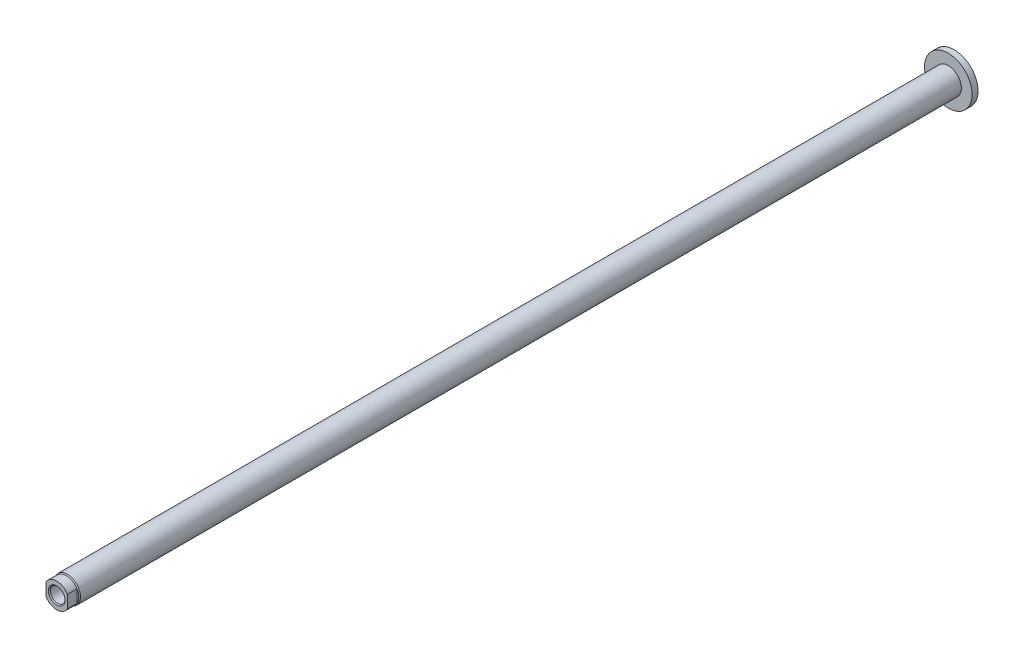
ISO-10303-21;
HEADER;
FILE_DESCRIPTION(('STEP AP214'),'2;1');
FILE_NAME('part.step','',(''),(''),'','','');
FILE_SCHEMA(('AUTOMOTIVE_DESIGN { 1 0 10303 214 1 1 1 1 }'));
ENDSEC;
DATA;
#1=APPLICATION_CONTEXT('core data for automotive mechanical design processes');
#2=APPLICATION_PROTOCOL_DEFINITION('international standard','automotive_design',2000,#1);
#3=PRODUCT_CONTEXT('',#1,'mechanical');
#4=PRODUCT('Part','Part','',(#3));
#5=PRODUCT_RELATED_PRODUCT_CATEGORY('part','',(#4));
#6=PRODUCT_DEFINITION_FORMATION('','',#4);
#7=PRODUCT_DEFINITION_CONTEXT('part definition',#1,'design');
#8=PRODUCT_DEFINITION('design','',#6,#7);
#9=PRODUCT_DEFINITION_SHAPE('','',#8);
#10=(LENGTH_UNIT() NAMED_UNIT(*) SI_UNIT(.MILLI.,.METRE.));
#11=(NAMED_UNIT(*) PLANE_ANGLE_UNIT() SI_UNIT($,.RADIAN.));
#12=(NAMED_UNIT(*) SI_UNIT($,.STERADIAN.) SOLID_ANGLE_UNIT());
#13=UNCERTAINTY_MEASURE_WITH_UNIT(LENGTH_MEASURE(1.E-05),#10,'distance_accuracy_value','');
#14=(GEOMETRIC_REPRESENTATION_CONTEXT(3) GLOBAL_UNCERTAINTY_ASSIGNED_CONTEXT((#13)) GLOBAL_UNIT_ASSIGNED_CONTEXT((#10,
#11,#12)) REPRESENTATION_CONTEXT('',''));
#15=CARTESIAN_POINT('',(0.,0.,0.));
#16=DIRECTION('',(0.,0.,1.));
#17=DIRECTION('',(1.,0.,0.));
#18=AXIS2_PLACEMENT_3D('',#15,#16,#17);
#19=CARTESIAN_POINT('',(0.,5.5,-735.));
#20=DIRECTION('',(0.,0.,-1.));
#21=DIRECTION('',(0.,1.,0.));
#22=AXIS2_PLACEMENT_3D('',#19,#20,#21);
#23=PLANE('',#22);
#24=CARTESIAN_POINT('',(0.,0.,-735.));
#25=DIRECTION('',(0.,0.,-1.));
#26=DIRECTION('',(-1.,0.,0.));
#27=AXIS2_PLACEMENT_3D('',#24,#25,#26);
#28=CIRCLE('',#27,20.);
#29=CARTESIAN_POINT('',(-20.,0.,-735.));
#30=VERTEX_POINT('',#29);
#31=EDGE_CURVE('E118',#30,#30,#28,.T.);
#32=ORIENTED_EDGE('',*,*,#31,.T.);
#33=EDGE_LOOP('',(#32));
#34=FACE_BOUND('',#33,.T.);
#35=ADVANCED_FACE('F16',(#34),#23,.T.);
#36=CARTESIAN_POINT('',(0.,0.,-362.476313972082));
#37=DIRECTION('',(0.,0.,1.));
#38=DIRECTION('',(0.,1.,0.));
#39=AXIS2_PLACEMENT_3D('',#36,#37,#38);
#40=CYLINDRICAL_SURFACE('',#39,11.);
#41=CARTESIAN_POINT('',(0.,0.,10.0473720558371));
#42=DIRECTION('',(0.,0.,-1.));
#43=DIRECTION('',(0.,1.,0.));
#44=AXIS2_PLACEMENT_3D('',#41,#42,#43);
#45=CIRCLE('',#44,11.);
#46=CARTESIAN_POINT('',(0.,11.,10.0473720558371));
#47=VERTEX_POINT('',#46);
#48=EDGE_CURVE('E11',#47,#47,#45,.T.);
#49=ORIENTED_EDGE('',*,*,#48,.T.);
#50=EDGE_LOOP('',(#49));
#51=FACE_BOUND('',#50,.T.);
#52=CARTESIAN_POINT('',(0.,0.,-730.));
#53=DIRECTION('',(0.,0.,1.));
#54=DIRECTION('',(0.,1.,0.));
#55=AXIS2_PLACEMENT_3D('',#52,#53,#54);
#56=CIRCLE('',#55,11.);
#57=CARTESIAN_POINT('',(0.,-11.,-730.));
#58=VERTEX_POINT('',#57);
#59=EDGE_CURVE('E121',#58,#58,#56,.T.);
#60=ORIENTED_EDGE('',*,*,#59,.T.);
#61=EDGE_LOOP('',(#60));
#62=FACE_BOUND('',#61,.T.);
#63=ADVANCED_FACE('F109',(#51,#62),#40,.T.);
#64=CARTESIAN_POINT('',(0.,0.,10.5236860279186));
#65=DIRECTION('',(0.,0.,-1.));
#66=DIRECTION('',(0.,1.,0.));
#67=AXIS2_PLACEMENT_3D('',#64,#65,#66);
#68=CONICAL_SURFACE('',#67,10.725,0.523598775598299);
#69=CARTESIAN_POINT('',(0.,0.,11.));
#70=DIRECTION('',(0.,0.,-1.));
#71=DIRECTION('',(0.,1.,0.));
#72=AXIS2_PLACEMENT_3D('',#69,#70,#71);
#73=CIRCLE('',#72,10.45);
#74=CARTESIAN_POINT('',(9.,-5.31060260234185,11.));
#75=VERTEX_POINT('',#74);
#76=CARTESIAN_POINT('',(-9.,-5.31060260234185,11.));
#77=VERTEX_POINT('',#76);
#78=EDGE_CURVE('E25',#75,#77,#73,.T.);
#79=ORIENTED_EDGE('',*,*,#78,.T.);
#80=CARTESIAN_POINT('',(0.,0.,11.));
#81=DIRECTION('',(0.,0.,-1.));
#82=DIRECTION('',(0.,1.,0.));
#83=AXIS2_PLACEMENT_3D('',#80,#81,#82);
#84=CIRCLE('',#83,10.45);
#85=CARTESIAN_POINT('',(-9.,5.31060260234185,11.));
#86=VERTEX_POINT('',#85);
#87=EDGE_CURVE('E153',#77,#86,#84,.T.);
#88=ORIENTED_EDGE('',*,*,#87,.T.);
#89=CARTESIAN_POINT('',(0.,0.,11.));
#90=DIRECTION('',(0.,0.,-1.));
#91=DIRECTION('',(0.,1.,0.));
#92=AXIS2_PLACEMENT_3D('',#89,#90,#91);
#93=CIRCLE('',#92,10.45);
#94=CARTESIAN_POINT('',(9.,5.31060260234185,11.));
#95=VERTEX_POINT('',#94);
#96=EDGE_CURVE('E128',#86,#95,#93,.T.);
#97=ORIENTED_EDGE('',*,*,#96,.T.);
#98=CARTESIAN_POINT('',(0.,0.,11.));
#99=DIRECTION('',(0.,0.,-1.));
#100=DIRECTION('',(0.,1.,0.));
#101=AXIS2_PLACEMENT_3D('',#98,#99,#100);
#102=CIRCLE('',#101,10.45);
#103=EDGE_CURVE('E129',#95,#75,#102,.T.);
#104=ORIENTED_EDGE('',*,*,#103,.T.);
#105=EDGE_LOOP('',(#79,#88,#97,#104));
#106=FACE_BOUND('',#105,.T.);
#107=ORIENTED_EDGE('',*,*,#48,.F.);
#108=EDGE_LOOP('',(#107));
#109=FACE_BOUND('',#108,.T.);
#110=ADVANCED_FACE('F114',(#106,#109),#68,.T.);
#111=CARTESIAN_POINT('',(0.,0.,15.));
#112=DIRECTION('',(0.,0.,1.));
#113=DIRECTION('',(0.,1.,0.));
#114=AXIS2_PLACEMENT_3D('',#111,#112,#113);
#115=CYLINDRICAL_SURFACE('',#114,10.45);
#116=DIRECTION('',(0.,0.,-1.));
#117=VECTOR('',#116,1.);
#118=CARTESIAN_POINT('',(-9.,-5.31060260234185,15.));
#119=LINE('',#118,#117);
#120=CARTESIAN_POINT('',(-9.,-5.31060260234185,19.));
#121=VERTEX_POINT('',#120);
#122=EDGE_CURVE('E159',#121,#77,#119,.T.);
#123=ORIENTED_EDGE('',*,*,#122,.T.);
#124=ORIENTED_EDGE('',*,*,#78,.F.);
#125=DIRECTION('',(0.,0.,1.));
#126=VECTOR('',#125,1.);
#127=CARTESIAN_POINT('',(9.,-5.31060260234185,15.));
#128=LINE('',#127,#126);
#129=CARTESIAN_POINT('',(9.,-5.31060260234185,19.));
#130=VERTEX_POINT('',#129);
#131=EDGE_CURVE('E145',#75,#130,#128,.T.);
#132=ORIENTED_EDGE('',*,*,#131,.T.);
#133=CARTESIAN_POINT('',(0.,0.,19.));
#134=DIRECTION('',(0.,0.,-1.));
#135=DIRECTION('',(0.,1.,0.));
#136=AXIS2_PLACEMENT_3D('',#133,#134,#135);
#137=CIRCLE('',#136,10.45);
#138=EDGE_CURVE('E138',#130,#121,#137,.T.);
#139=ORIENTED_EDGE('',*,*,#138,.T.);
#140=EDGE_LOOP('',(#123,#124,#132,#139));
#141=FACE_BOUND('',#140,.T.);
#142=ADVANCED_FACE('F102',(#141),#115,.T.);
#143=CARTESIAN_POINT('',(0.,5.225,19.));
#144=DIRECTION('',(0.,0.,1.));
#145=DIRECTION('',(0.,-1.,0.));
#146=AXIS2_PLACEMENT_3D('',#143,#144,#145);
#147=PLANE('',#146);
#148=CARTESIAN_POINT('',(0.,0.,19.));
#149=DIRECTION('',(0.,0.,-1.));
#150=DIRECTION('',(0.,1.,0.));
#151=AXIS2_PLACEMENT_3D('',#148,#149,#150);
#152=CIRCLE('',#151,7.);
#153=CARTESIAN_POINT('',(0.,7.,19.));
#154=VERTEX_POINT('',#153);
#155=EDGE_CURVE('E19',#154,#154,#152,.T.);
#156=ORIENTED_EDGE('',*,*,#155,.T.);
#157=EDGE_LOOP('',(#156));
#158=FACE_BOUND('',#157,.T.);
#159=DIRECTION('',(0.,-1.,0.));
#160=VECTOR('',#159,1.);
#161=CARTESIAN_POINT('',(-9.,2.6125,19.));
#162=LINE('',#161,#160);
#163=CARTESIAN_POINT('',(-9.,5.31060260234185,19.));
#164=VERTEX_POINT('',#163);
#165=EDGE_CURVE('E135',#164,#121,#162,.T.);
#166=ORIENTED_EDGE('',*,*,#165,.T.);
#167=ORIENTED_EDGE('',*,*,#138,.F.);
#168=DIRECTION('',(0.,1.,0.));
#169=VECTOR('',#168,1.);
#170=CARTESIAN_POINT('',(9.,2.6125,19.));
#171=LINE('',#170,#169);
#172=CARTESIAN_POINT('',(9.,5.31060260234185,19.));
#173=VERTEX_POINT('',#172);
#174=EDGE_CURVE('E74',#130,#173,#171,.T.);
#175=ORIENTED_EDGE('',*,*,#174,.T.);
#176=CARTESIAN_POINT('',(0.,0.,19.));
#177=DIRECTION('',(0.,0.,-1.));
#178=DIRECTION('',(0.,1.,0.));
#179=AXIS2_PLACEMENT_3D('',#176,#177,#178);
#180=CIRCLE('',#179,10.45);
#181=EDGE_CURVE('E134',#164,#173,#180,.T.);
#182=ORIENTED_EDGE('',*,*,#181,.F.);
#183=EDGE_LOOP('',(#166,#167,#175,#182));
#184=FACE_BOUND('',#183,.T.);
#185=ADVANCED_FACE('F91',(#158,#184),#147,.T.);
#186=CARTESIAN_POINT('',(0.,0.,-10.2863578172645));
#187=DIRECTION('',(0.,0.,1.));
#188=DIRECTION('',(0.,1.,0.));
#189=AXIS2_PLACEMENT_3D('',#186,#187,#188);
#190=CONICAL_SURFACE('',#189,3.0940625,1.0471975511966);
#191=CARTESIAN_POINT('',(0.,0.,-8.5));
#192=DIRECTION('',(0.,0.,-1.));
#193=DIRECTION('',(0.,1.,0.));
#194=AXIS2_PLACEMENT_3D('',#191,#192,#193);
#195=CIRCLE('',#194,6.188125);
#196=CARTESIAN_POINT('',(0.,6.188125,-8.5));
#197=VERTEX_POINT('',#196);
#198=EDGE_CURVE('E136',#197,#197,#195,.T.);
#199=ORIENTED_EDGE('',*,*,#198,.F.);
#200=EDGE_LOOP('',(#199));
#201=FACE_BOUND('',#200,.T.);
#202=CARTESIAN_POINT('',(0.,0.,-12.0727156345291));
#203=VERTEX_POINT('',#202);
#204=VERTEX_LOOP('',#203);
#205=FACE_BOUND('',#204,.T.);
#206=ADVANCED_FACE('F88',(#201,#205),#190,.F.);
#207=CARTESIAN_POINT('',(0.,0.,-7.6559375));
#208=DIRECTION('',(0.,0.,1.));
#209=DIRECTION('',(0.,1.,0.));
#210=AXIS2_PLACEMENT_3D('',#207,#208,#209);
#211=CYLINDRICAL_SURFACE('',#210,6.188125);
#212=CARTESIAN_POINT('',(0.,0.,-6.811875));
#213=DIRECTION('',(0.,0.,-1.));
#214=DIRECTION('',(0.,1.,0.));
#215=AXIS2_PLACEMENT_3D('',#212,#213,#214);
#216=CIRCLE('',#215,6.188125);
#217=CARTESIAN_POINT('',(0.,6.188125,-6.811875));
#218=VERTEX_POINT('',#217);
#219=EDGE_CURVE('E139',#218,#218,#216,.T.);
#220=ORIENTED_EDGE('',*,*,#219,.F.);
#221=EDGE_LOOP('',(#220));
#222=FACE_BOUND('',#221,.T.);
#223=ORIENTED_EDGE('',*,*,#198,.T.);
#224=EDGE_LOOP('',(#223));
#225=FACE_BOUND('',#224,.T.);
#226=ADVANCED_FACE('F90',(#222,#225),#211,.F.);
#227=CARTESIAN_POINT('',(0.,0.,-6.4059375));
#228=DIRECTION('',(0.,0.,1.));
#229=DIRECTION('',(0.,1.,0.));
#230=AXIS2_PLACEMENT_3D('',#227,#228,#229);
#231=CONICAL_SURFACE('',#230,6.5940625,0.785398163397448);
#232=CARTESIAN_POINT('',(0.,0.,-6.));
#233=DIRECTION('',(0.,0.,-1.));
#234=DIRECTION('',(0.,1.,0.));
#235=AXIS2_PLACEMENT_3D('',#232,#233,#234);
#236=CIRCLE('',#235,7.);
#237=CARTESIAN_POINT('',(0.,7.,-6.));
#238=VERTEX_POINT('',#237);
#239=EDGE_CURVE('E141',#238,#238,#236,.T.);
#240=ORIENTED_EDGE('',*,*,#239,.F.);
#241=EDGE_LOOP('',(#240));
#242=FACE_BOUND('',#241,.T.);
#243=ORIENTED_EDGE('',*,*,#219,.T.);
#244=EDGE_LOOP('',(#243));
#245=FACE_BOUND('',#244,.T.);
#246=ADVANCED_FACE('F99',(#242,#245),#231,.F.);
#247=CARTESIAN_POINT('',(0.,6.5940625,-6.));
#248=DIRECTION('',(0.,0.,1.));
#249=DIRECTION('',(0.,-1.,0.));
#250=AXIS2_PLACEMENT_3D('',#247,#248,#249);
#251=PLANE('',#250);
#252=CARTESIAN_POINT('',(0.,0.,-6.));
#253=DIRECTION('',(0.,0.,-1.));
#254=DIRECTION('',(0.,1.,0.));
#255=AXIS2_PLACEMENT_3D('',#252,#253,#254);
#256=CIRCLE('',#255,6.188125);
#257=CARTESIAN_POINT('',(0.,6.188125,-6.));
#258=VERTEX_POINT('',#257);
#259=EDGE_CURVE('E148',#258,#258,#256,.T.);
#260=ORIENTED_EDGE('',*,*,#259,.F.);
#261=EDGE_LOOP('',(#260));
#262=FACE_BOUND('',#261,.T.);
#263=ORIENTED_EDGE('',*,*,#239,.T.);
#264=EDGE_LOOP('',(#263));
#265=FACE_BOUND('',#264,.T.);
#266=ADVANCED_FACE('F227',(#262,#265),#251,.F.);
#267=CARTESIAN_POINT('',(0.,0.,6.0940625));
#268=DIRECTION('',(0.,0.,1.));
#269=DIRECTION('',(0.,1.,0.));
#270=AXIS2_PLACEMENT_3D('',#267,#268,#269);
#271=CYLINDRICAL_SURFACE('',#270,6.188125);
#272=CARTESIAN_POINT('',(0.,0.,18.188125));
#273=DIRECTION('',(0.,0.,-1.));
#274=DIRECTION('',(0.,1.,0.));
#275=AXIS2_PLACEMENT_3D('',#272,#273,#274);
#276=CIRCLE('',#275,6.188125);
#277=CARTESIAN_POINT('',(0.,6.188125,18.188125));
#278=VERTEX_POINT('',#277);
#279=EDGE_CURVE('E120',#278,#278,#276,.T.);
#280=ORIENTED_EDGE('',*,*,#279,.F.);
#281=EDGE_LOOP('',(#280));
#282=FACE_BOUND('',#281,.T.);
#283=ORIENTED_EDGE('',*,*,#259,.T.);
#284=EDGE_LOOP('',(#283));
#285=FACE_BOUND('',#284,.T.);
#286=ADVANCED_FACE('F223',(#282,#285),#271,.F.);
#287=CARTESIAN_POINT('',(0.,0.,18.5940625));
#288=DIRECTION('',(0.,0.,1.));
#289=DIRECTION('',(0.,1.,0.));
#290=AXIS2_PLACEMENT_3D('',#287,#288,#289);
#291=CONICAL_SURFACE('',#290,6.5940625,0.785398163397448);
#292=ORIENTED_EDGE('',*,*,#155,.F.);
#293=EDGE_LOOP('',(#292));
#294=FACE_BOUND('',#293,.T.);
#295=ORIENTED_EDGE('',*,*,#279,.T.);
#296=EDGE_LOOP('',(#295));
#297=FACE_BOUND('',#296,.T.);
#298=ADVANCED_FACE('F213',(#294,#297),#291,.F.);
#299=CARTESIAN_POINT('',(0.,0.,-732.5));
#300=DIRECTION('',(0.,0.,1.));
#301=DIRECTION('',(-1.,0.,0.));
#302=AXIS2_PLACEMENT_3D('',#299,#300,#301);
#303=CYLINDRICAL_SURFACE('',#302,20.);
#304=ORIENTED_EDGE('',*,*,#31,.F.);
#305=EDGE_LOOP('',(#304));
#306=FACE_BOUND('',#305,.T.);
#307=CARTESIAN_POINT('',(0.,0.,-730.));
#308=DIRECTION('',(0.,0.,1.));
#309=DIRECTION('',(-1.,0.,0.));
#310=AXIS2_PLACEMENT_3D('',#307,#308,#309);
#311=CIRCLE('',#310,20.);
#312=CARTESIAN_POINT('',(-20.,0.,-730.));
#313=VERTEX_POINT('',#312);
#314=EDGE_CURVE('E124',#313,#313,#311,.T.);
#315=ORIENTED_EDGE('',*,*,#314,.F.);
#316=EDGE_LOOP('',(#315));
#317=FACE_BOUND('',#316,.T.);
#318=ADVANCED_FACE('F208',(#306,#317),#303,.T.);
#319=CARTESIAN_POINT('',(0.,0.,-730.));
#320=DIRECTION('',(0.,0.,1.));
#321=DIRECTION('',(1.,0.,0.));
#322=AXIS2_PLACEMENT_3D('',#319,#320,#321);
#323=PLANE('',#322);
#324=ORIENTED_EDGE('',*,*,#59,.F.);
#325=EDGE_LOOP('',(#324));
#326=FACE_BOUND('',#325,.T.);
#327=ORIENTED_EDGE('',*,*,#314,.T.);
#328=EDGE_LOOP('',(#327));
#329=FACE_BOUND('',#328,.T.);
#330=ADVANCED_FACE('F204',(#326,#329),#323,.T.);
#331=CARTESIAN_POINT('',(9.,0.,15.5));
#332=DIRECTION('',(1.,0.,0.));
#333=DIRECTION('',(0.,0.,-1.));
#334=AXIS2_PLACEMENT_3D('',#331,#332,#333);
#335=PLANE('',#334);
#336=DIRECTION('',(0.,0.,-1.));
#337=VECTOR('',#336,1.);
#338=CARTESIAN_POINT('',(9.,5.31060260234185,15.));
#339=LINE('',#338,#337);
#340=EDGE_CURVE('E144',#173,#95,#339,.T.);
#341=ORIENTED_EDGE('',*,*,#340,.F.);
#342=ORIENTED_EDGE('',*,*,#174,.F.);
#343=ORIENTED_EDGE('',*,*,#131,.F.);
#344=DIRECTION('',(0.,-1.,0.));
#345=VECTOR('',#344,1.);
#346=CARTESIAN_POINT('',(9.,0.,11.));
#347=LINE('',#346,#345);
#348=EDGE_CURVE('E66',#95,#75,#347,.T.);
#349=ORIENTED_EDGE('',*,*,#348,.F.);
#350=EDGE_LOOP('',(#341,#342,#343,#349));
#351=FACE_BOUND('',#350,.T.);
#352=ADVANCED_FACE('F190',(#351),#335,.T.);
#353=CARTESIAN_POINT('',(20.,0.,11.));
#354=DIRECTION('',(0.,0.,1.));
#355=DIRECTION('',(1.,0.,0.));
#356=AXIS2_PLACEMENT_3D('',#353,#354,#355);
#357=PLANE('',#356);
#358=ORIENTED_EDGE('',*,*,#103,.F.);
#359=ORIENTED_EDGE('',*,*,#348,.T.);
#360=EDGE_LOOP('',(#358,#359));
#361=FACE_BOUND('',#360,.T.);
#362=ADVANCED_FACE('F196',(#361),#357,.T.);
#363=CARTESIAN_POINT('',(0.,0.,15.));
#364=DIRECTION('',(0.,0.,1.));
#365=DIRECTION('',(0.,1.,0.));
#366=AXIS2_PLACEMENT_3D('',#363,#364,#365);
#367=CYLINDRICAL_SURFACE('',#366,10.45);
#368=DIRECTION('',(0.,0.,1.));
#369=VECTOR('',#368,1.);
#370=CARTESIAN_POINT('',(-9.,5.31060260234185,15.));
#371=LINE('',#370,#369);
#372=EDGE_CURVE('E131',#86,#164,#371,.T.);
#373=ORIENTED_EDGE('',*,*,#372,.T.);
#374=ORIENTED_EDGE('',*,*,#181,.T.);
#375=ORIENTED_EDGE('',*,*,#340,.T.);
#376=ORIENTED_EDGE('',*,*,#96,.F.);
#377=EDGE_LOOP('',(#373,#374,#375,#376));
#378=FACE_BOUND('',#377,.T.);
#379=ADVANCED_FACE('F194',(#378),#367,.T.);
#380=CARTESIAN_POINT('',(-9.,0.,15.5));
#381=DIRECTION('',(-1.,0.,0.));
#382=DIRECTION('',(0.,0.,-1.));
#383=AXIS2_PLACEMENT_3D('',#380,#381,#382);
#384=PLANE('',#383);
#385=ORIENTED_EDGE('',*,*,#122,.F.);
#386=ORIENTED_EDGE('',*,*,#165,.F.);
#387=ORIENTED_EDGE('',*,*,#372,.F.);
#388=DIRECTION('',(0.,1.,0.));
#389=VECTOR('',#388,1.);
#390=CARTESIAN_POINT('',(-9.,0.,11.));
#391=LINE('',#390,#389);
#392=EDGE_CURVE('E156',#77,#86,#391,.T.);
#393=ORIENTED_EDGE('',*,*,#392,.F.);
#394=EDGE_LOOP('',(#385,#386,#387,#393));
#395=FACE_BOUND('',#394,.T.);
#396=ADVANCED_FACE('F179',(#395),#384,.T.);
#397=CARTESIAN_POINT('',(-20.,0.,11.));
#398=DIRECTION('',(0.,0.,1.));
#399=DIRECTION('',(-1.,0.,0.));
#400=AXIS2_PLACEMENT_3D('',#397,#398,#399);
#401=PLANE('',#400);
#402=ORIENTED_EDGE('',*,*,#87,.F.);
#403=ORIENTED_EDGE('',*,*,#392,.T.);
#404=EDGE_LOOP('',(#402,#403));
#405=FACE_BOUND('',#404,.T.);
#406=ADVANCED_FACE('F181',(#405),#401,.T.);
#407=CLOSED_SHELL('',(#35,#63,#110,#142,#185,#206,#226,#246,#266,#286,#298,#318,#330,#352,#362,
#379,#396,#406));
#408=MANIFOLD_SOLID_BREP('B1',#407);
#409=ADVANCED_BREP_SHAPE_REPRESENTATION('',(#18,#408),#14);
#410=SHAPE_DEFINITION_REPRESENTATION(#9,#409);
ENDSEC;
END-ISO-10303-21;
